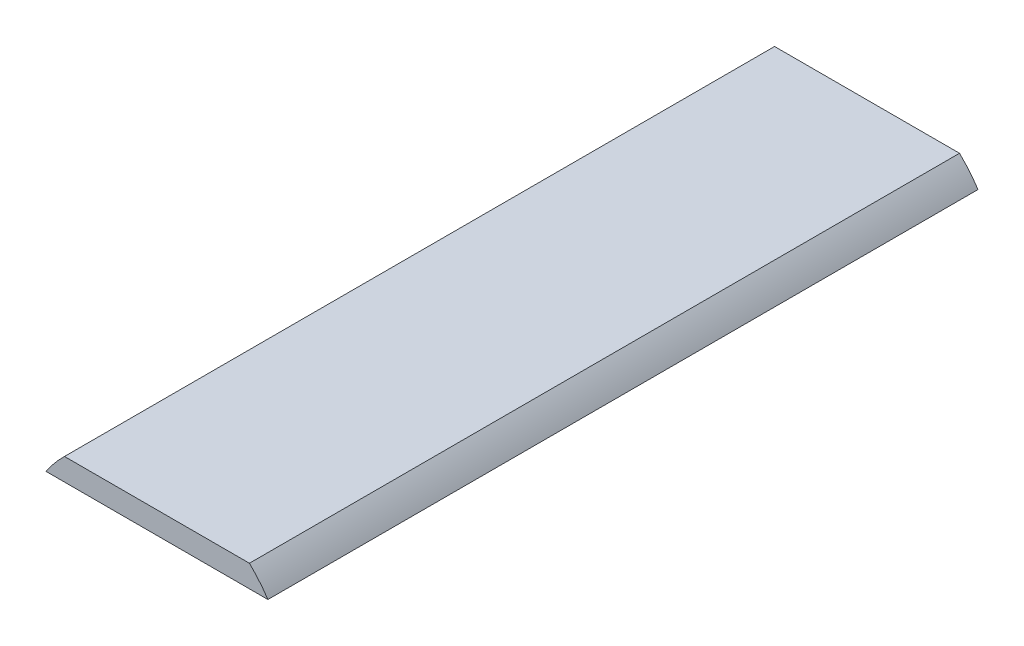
from build123d import *

# Parameters (mm, degrees)
SKETCH1_R          = 19.05
EXTRUDE1_DEPTH     = 101.6
CUT_EXTRUDE1_DEPTH = 106.111203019


with BuildPart() as part:
    # Sketch1 → Extrude1 (new body)
    with BuildSketch(Plane.XY):
        Circle(SKETCH1_R)
    extrude(amount=EXTRUDE1_DEPTH)

    # Sketch2 → Cut-Extrude1 (cut, through all)
    with BuildSketch(Plane.XY.offset(101.6)):
        with BuildLine():
            Line((-13.231315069, 13.705283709), (13.231315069, 13.705283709))
            ThreePointArc((13.231315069, 13.705283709), (0, 19.05), (-13.231315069, 13.705283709))
        make_face()
        with BuildLine():
            Line((-15.875, 10.530283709), (15.875, 10.530283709))
            ThreePointArc((15.875, 10.530283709), (0, -19.05), (-15.875, 10.530283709))
        make_face()
    extrude(amount=-CUT_EXTRUDE1_DEPTH, mode=Mode.SUBTRACT)


solid = part.part
